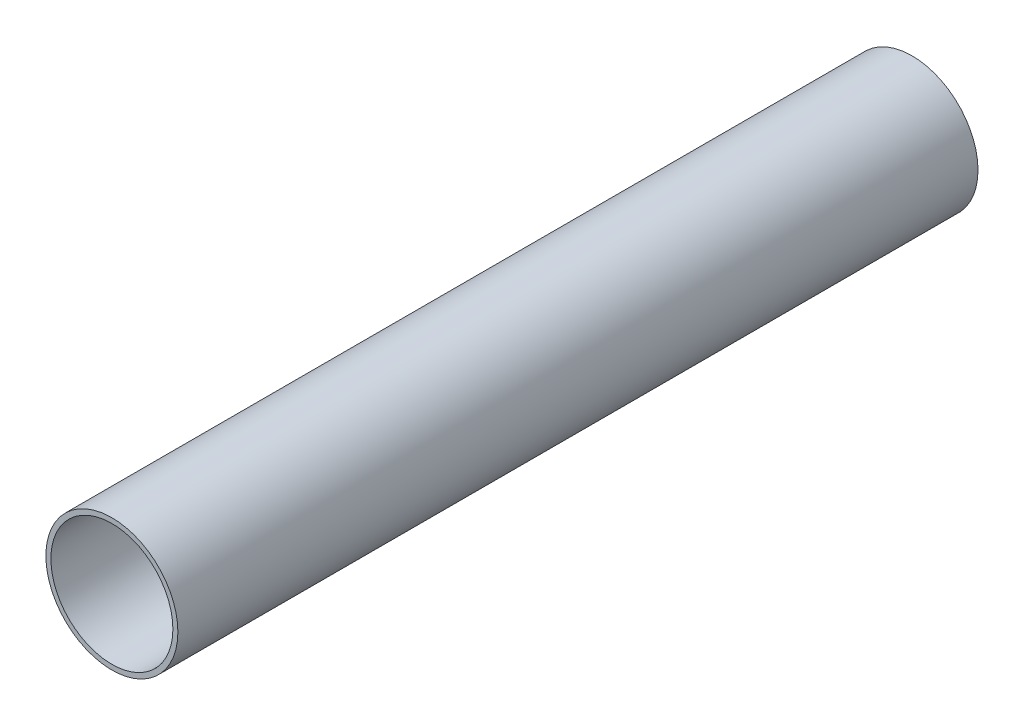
from build123d import *

# Parameters (mm, degrees)
SKETCH1_R      = 20.955
SKETCH1_R_2    = 19.3675
EXTRUDE1_DEPTH = 254


with BuildPart() as part:
    # Sketch1 → Extrude1 (new body)
    with BuildSketch(Plane.XY):
        Circle(SKETCH1_R)
        Circle(SKETCH1_R_2, mode=Mode.SUBTRACT)
    extrude(amount=EXTRUDE1_DEPTH)


solid = part.part
